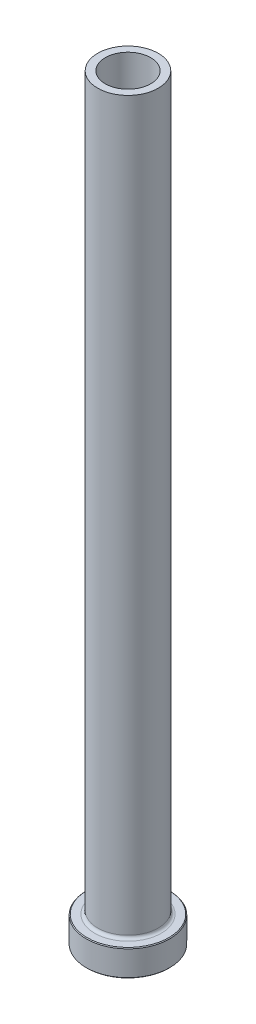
from build123d import *

# Parameters (mm, degrees)
FILLET1_R     = 0.8
CHAMFER1_SIZE = 0.2
CHAMFER3_SIZE = 0.5


with BuildPart() as part:
    # Sketch1 → Revolve1 (revolve)
    with BuildSketch(Plane.XY, mode=Mode.PRIVATE) as revolve1_sk:
        Polygon((-6, 200), (-8, 200), (-8, 7), (-11, 7), (-11, 0), (-6.25, 0), (-6.25, 133), (-6, 145), align=None)
    revolve(revolve1_sk.sketch.rotate(Axis((0, 92.187680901, 0), (0, -1, 0)), 270), axis=Axis((0, 92.187680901, 0), (0, -1, 0)))

    # Fillet1
    fillet1_edges = [part.edges().sort_by_distance(p)[0] for p in [
        (0, 7, -8),
    ]]
    fillet(fillet1_edges, radius=FILLET1_R)

    # Chamfer1
    chamfer1_edges = [part.edges().sort_by_distance(p)[0] for p in [
        (0, 0, -11),
        (0, 7, -11),
    ]]
    chamfer(chamfer1_edges, length=CHAMFER1_SIZE)

    # Chamfer3
    chamfer3_edges = [part.edges().sort_by_distance(p)[0] for p in [
        (0, 0, -6.25),
    ]]
    chamfer(chamfer3_edges, length=CHAMFER3_SIZE)


solid = part.part
